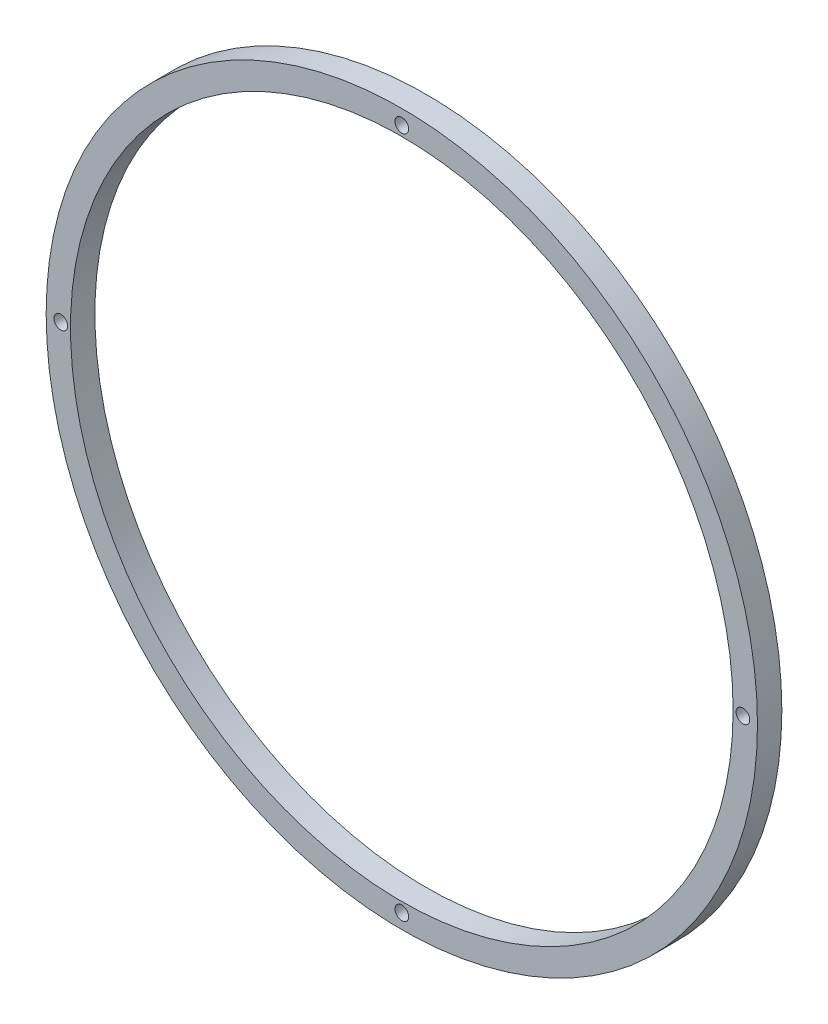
ISO-10303-21;
HEADER;
FILE_DESCRIPTION(('STEP AP214'),'2;1');
FILE_NAME('part.step','',(''),(''),'','','');
FILE_SCHEMA(('AUTOMOTIVE_DESIGN { 1 0 10303 214 1 1 1 1 }'));
ENDSEC;
DATA;
#1=APPLICATION_CONTEXT('core data for automotive mechanical design processes');
#2=APPLICATION_PROTOCOL_DEFINITION('international standard','automotive_design',2000,#1);
#3=PRODUCT_CONTEXT('',#1,'mechanical');
#4=PRODUCT('Part','Part','',(#3));
#5=PRODUCT_RELATED_PRODUCT_CATEGORY('part','',(#4));
#6=PRODUCT_DEFINITION_FORMATION('','',#4);
#7=PRODUCT_DEFINITION_CONTEXT('part definition',#1,'design');
#8=PRODUCT_DEFINITION('design','',#6,#7);
#9=PRODUCT_DEFINITION_SHAPE('','',#8);
#10=(LENGTH_UNIT() NAMED_UNIT(*) SI_UNIT(.MILLI.,.METRE.));
#11=(NAMED_UNIT(*) PLANE_ANGLE_UNIT() SI_UNIT($,.RADIAN.));
#12=(NAMED_UNIT(*) SI_UNIT($,.STERADIAN.) SOLID_ANGLE_UNIT());
#13=UNCERTAINTY_MEASURE_WITH_UNIT(LENGTH_MEASURE(1.E-05),#10,'distance_accuracy_value','');
#14=(GEOMETRIC_REPRESENTATION_CONTEXT(3) GLOBAL_UNCERTAINTY_ASSIGNED_CONTEXT((#13)) GLOBAL_UNIT_ASSIGNED_CONTEXT((#10,
#11,#12)) REPRESENTATION_CONTEXT('',''));
#15=CARTESIAN_POINT('',(0.,0.,0.));
#16=DIRECTION('',(0.,0.,1.));
#17=DIRECTION('',(1.,0.,0.));
#18=AXIS2_PLACEMENT_3D('',#15,#16,#17);
#19=CARTESIAN_POINT('',(0.,0.,6.35));
#20=DIRECTION('',(0.,0.,-1.));
#21=DIRECTION('',(-1.,0.,0.));
#22=AXIS2_PLACEMENT_3D('',#19,#20,#21);
#23=CYLINDRICAL_SURFACE('',#22,86.36);
#24=CARTESIAN_POINT('',(0.,0.,6.35));
#25=DIRECTION('',(0.,0.,1.));
#26=DIRECTION('',(1.,0.,0.));
#27=AXIS2_PLACEMENT_3D('',#24,#25,#26);
#28=CIRCLE('',#27,86.36);
#29=CARTESIAN_POINT('',(86.36,0.,6.35));
#30=VERTEX_POINT('',#29);
#31=EDGE_CURVE('E40',#30,#30,#28,.T.);
#32=ORIENTED_EDGE('',*,*,#31,.T.);
#33=EDGE_LOOP('',(#32));
#34=FACE_BOUND('',#33,.T.);
#35=CARTESIAN_POINT('',(0.,0.,0.));
#36=DIRECTION('',(0.,0.,1.));
#37=DIRECTION('',(1.,0.,0.));
#38=AXIS2_PLACEMENT_3D('',#35,#36,#37);
#39=CIRCLE('',#38,86.36);
#40=CARTESIAN_POINT('',(86.36,0.,0.));
#41=VERTEX_POINT('',#40);
#42=EDGE_CURVE('E60',#41,#41,#39,.T.);
#43=ORIENTED_EDGE('',*,*,#42,.F.);
#44=EDGE_LOOP('',(#43));
#45=FACE_BOUND('',#44,.T.);
#46=ADVANCED_FACE('F32',(#34,#45),#23,.F.);
#47=CARTESIAN_POINT('',(0.,88.9,6.35));
#48=DIRECTION('',(0.,0.,-1.));
#49=DIRECTION('',(-1.,0.,0.));
#50=AXIS2_PLACEMENT_3D('',#47,#48,#49);
#51=CYLINDRICAL_SURFACE('',#50,1.7859375);
#52=CARTESIAN_POINT('',(0.,88.9,6.35));
#53=DIRECTION('',(0.,0.,1.));
#54=DIRECTION('',(1.,0.,0.));
#55=AXIS2_PLACEMENT_3D('',#52,#53,#54);
#56=CIRCLE('',#55,1.7859375);
#57=CARTESIAN_POINT('',(1.7859375,88.9,6.35));
#58=VERTEX_POINT('',#57);
#59=EDGE_CURVE('E45',#58,#58,#56,.T.);
#60=ORIENTED_EDGE('',*,*,#59,.T.);
#61=EDGE_LOOP('',(#60));
#62=FACE_BOUND('',#61,.T.);
#63=CARTESIAN_POINT('',(0.,88.9,0.));
#64=DIRECTION('',(0.,0.,1.));
#65=DIRECTION('',(1.,0.,0.));
#66=AXIS2_PLACEMENT_3D('',#63,#64,#65);
#67=CIRCLE('',#66,1.7859375);
#68=CARTESIAN_POINT('',(1.7859375,88.9,0.));
#69=VERTEX_POINT('',#68);
#70=EDGE_CURVE('E58',#69,#69,#67,.T.);
#71=ORIENTED_EDGE('',*,*,#70,.F.);
#72=EDGE_LOOP('',(#71));
#73=FACE_BOUND('',#72,.T.);
#74=ADVANCED_FACE('F81',(#62,#73),#51,.F.);
#75=CARTESIAN_POINT('',(88.9,2.4980018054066E-12,6.35));
#76=DIRECTION('',(0.,0.,-1.));
#77=DIRECTION('',(-1.,0.,0.));
#78=AXIS2_PLACEMENT_3D('',#75,#76,#77);
#79=CYLINDRICAL_SURFACE('',#78,1.78593750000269);
#80=CARTESIAN_POINT('',(88.9,2.4980018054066E-12,6.35));
#81=DIRECTION('',(0.,0.,1.));
#82=DIRECTION('',(1.,0.,0.));
#83=AXIS2_PLACEMENT_3D('',#80,#81,#82);
#84=CIRCLE('',#83,1.78593750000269);
#85=CARTESIAN_POINT('',(90.6859375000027,2.4980018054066E-12,6.35));
#86=VERTEX_POINT('',#85);
#87=EDGE_CURVE('E74',#86,#86,#84,.T.);
#88=ORIENTED_EDGE('',*,*,#87,.T.);
#89=EDGE_LOOP('',(#88));
#90=FACE_BOUND('',#89,.T.);
#91=CARTESIAN_POINT('',(88.9,2.4980018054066E-12,0.));
#92=DIRECTION('',(0.,0.,1.));
#93=DIRECTION('',(1.,0.,0.));
#94=AXIS2_PLACEMENT_3D('',#91,#92,#93);
#95=CIRCLE('',#94,1.78593750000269);
#96=CARTESIAN_POINT('',(90.6859375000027,2.4980018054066E-12,0.));
#97=VERTEX_POINT('',#96);
#98=EDGE_CURVE('E55',#97,#97,#95,.T.);
#99=ORIENTED_EDGE('',*,*,#98,.F.);
#100=EDGE_LOOP('',(#99));
#101=FACE_BOUND('',#100,.T.);
#102=ADVANCED_FACE('F99',(#90,#101),#79,.F.);
#103=CARTESIAN_POINT('',(2.54744696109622E-12,-88.8999999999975,6.35));
#104=DIRECTION('',(0.,0.,-1.));
#105=DIRECTION('',(-1.,0.,0.));
#106=AXIS2_PLACEMENT_3D('',#103,#104,#105);
#107=CYLINDRICAL_SURFACE('',#106,1.78593750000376);
#108=CARTESIAN_POINT('',(2.54744696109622E-12,-88.8999999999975,6.35));
#109=DIRECTION('',(0.,0.,1.));
#110=DIRECTION('',(1.,0.,0.));
#111=AXIS2_PLACEMENT_3D('',#108,#109,#110);
#112=CIRCLE('',#111,1.78593750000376);
#113=CARTESIAN_POINT('',(1.78593750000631,-88.8999999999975,6.35));
#114=VERTEX_POINT('',#113);
#115=EDGE_CURVE('E69',#114,#114,#112,.T.);
#116=ORIENTED_EDGE('',*,*,#115,.T.);
#117=EDGE_LOOP('',(#116));
#118=FACE_BOUND('',#117,.T.);
#119=CARTESIAN_POINT('',(2.54744696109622E-12,-88.8999999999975,0.));
#120=DIRECTION('',(0.,0.,1.));
#121=DIRECTION('',(1.,0.,0.));
#122=AXIS2_PLACEMENT_3D('',#119,#120,#121);
#123=CIRCLE('',#122,1.78593750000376);
#124=CARTESIAN_POINT('',(1.78593750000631,-88.8999999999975,0.));
#125=VERTEX_POINT('',#124);
#126=EDGE_CURVE('E52',#125,#125,#123,.T.);
#127=ORIENTED_EDGE('',*,*,#126,.F.);
#128=EDGE_LOOP('',(#127));
#129=FACE_BOUND('',#128,.T.);
#130=ADVANCED_FACE('F105',(#118,#129),#107,.F.);
#131=CARTESIAN_POINT('',(-88.8999999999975,0.,6.35));
#132=DIRECTION('',(0.,0.,-1.));
#133=DIRECTION('',(-1.,0.,0.));
#134=AXIS2_PLACEMENT_3D('',#131,#132,#133);
#135=CYLINDRICAL_SURFACE('',#134,1.78593750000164);
#136=CARTESIAN_POINT('',(-88.8999999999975,0.,6.35));
#137=DIRECTION('',(0.,0.,1.));
#138=DIRECTION('',(1.,0.,0.));
#139=AXIS2_PLACEMENT_3D('',#136,#137,#138);
#140=CIRCLE('',#139,1.78593750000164);
#141=CARTESIAN_POINT('',(-87.1140624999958,0.,6.35));
#142=VERTEX_POINT('',#141);
#143=EDGE_CURVE('E65',#142,#142,#140,.T.);
#144=ORIENTED_EDGE('',*,*,#143,.T.);
#145=EDGE_LOOP('',(#144));
#146=FACE_BOUND('',#145,.T.);
#147=CARTESIAN_POINT('',(-88.8999999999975,0.,0.));
#148=DIRECTION('',(0.,0.,1.));
#149=DIRECTION('',(1.,0.,0.));
#150=AXIS2_PLACEMENT_3D('',#147,#148,#149);
#151=CIRCLE('',#150,1.78593750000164);
#152=CARTESIAN_POINT('',(-87.1140624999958,0.,0.));
#153=VERTEX_POINT('',#152);
#154=EDGE_CURVE('E49',#153,#153,#151,.T.);
#155=ORIENTED_EDGE('',*,*,#154,.F.);
#156=EDGE_LOOP('',(#155));
#157=FACE_BOUND('',#156,.T.);
#158=ADVANCED_FACE('F34',(#146,#157),#135,.F.);
#159=CARTESIAN_POINT('',(0.,0.,6.35));
#160=DIRECTION('',(0.,0.,-1.));
#161=DIRECTION('',(-1.,0.,0.));
#162=AXIS2_PLACEMENT_3D('',#159,#160,#161);
#163=CYLINDRICAL_SURFACE('',#162,92.71);
#164=CARTESIAN_POINT('',(0.,0.,6.35));
#165=DIRECTION('',(0.,0.,1.));
#166=DIRECTION('',(1.,0.,0.));
#167=AXIS2_PLACEMENT_3D('',#164,#165,#166);
#168=CIRCLE('',#167,92.71);
#169=CARTESIAN_POINT('',(92.71,0.,6.35));
#170=VERTEX_POINT('',#169);
#171=EDGE_CURVE('E10',#170,#170,#168,.T.);
#172=ORIENTED_EDGE('',*,*,#171,.F.);
#173=EDGE_LOOP('',(#172));
#174=FACE_BOUND('',#173,.T.);
#175=CARTESIAN_POINT('',(0.,0.,0.));
#176=DIRECTION('',(0.,0.,1.));
#177=DIRECTION('',(1.,0.,0.));
#178=AXIS2_PLACEMENT_3D('',#175,#176,#177);
#179=CIRCLE('',#178,92.71);
#180=CARTESIAN_POINT('',(92.71,0.,0.));
#181=VERTEX_POINT('',#180);
#182=EDGE_CURVE('E36',#181,#181,#179,.T.);
#183=ORIENTED_EDGE('',*,*,#182,.T.);
#184=EDGE_LOOP('',(#183));
#185=FACE_BOUND('',#184,.T.);
#186=ADVANCED_FACE('F88',(#174,#185),#163,.T.);
#187=CARTESIAN_POINT('',(0.,0.,6.35));
#188=DIRECTION('',(0.,0.,1.));
#189=DIRECTION('',(1.,0.,0.));
#190=AXIS2_PLACEMENT_3D('',#187,#188,#189);
#191=PLANE('',#190);
#192=ORIENTED_EDGE('',*,*,#143,.F.);
#193=EDGE_LOOP('',(#192));
#194=FACE_BOUND('',#193,.T.);
#195=ORIENTED_EDGE('',*,*,#115,.F.);
#196=EDGE_LOOP('',(#195));
#197=FACE_BOUND('',#196,.T.);
#198=ORIENTED_EDGE('',*,*,#87,.F.);
#199=EDGE_LOOP('',(#198));
#200=FACE_BOUND('',#199,.T.);
#201=ORIENTED_EDGE('',*,*,#59,.F.);
#202=EDGE_LOOP('',(#201));
#203=FACE_BOUND('',#202,.T.);
#204=ORIENTED_EDGE('',*,*,#31,.F.);
#205=EDGE_LOOP('',(#204));
#206=FACE_BOUND('',#205,.T.);
#207=ORIENTED_EDGE('',*,*,#171,.T.);
#208=EDGE_LOOP('',(#207));
#209=FACE_BOUND('',#208,.T.);
#210=ADVANCED_FACE('F84',(#194,#197,#200,#203,#206,#209),#191,.T.);
#211=CARTESIAN_POINT('',(0.,0.,0.));
#212=DIRECTION('',(0.,0.,1.));
#213=DIRECTION('',(1.,0.,0.));
#214=AXIS2_PLACEMENT_3D('',#211,#212,#213);
#215=PLANE('',#214);
#216=ORIENTED_EDGE('',*,*,#154,.T.);
#217=EDGE_LOOP('',(#216));
#218=FACE_BOUND('',#217,.T.);
#219=ORIENTED_EDGE('',*,*,#126,.T.);
#220=EDGE_LOOP('',(#219));
#221=FACE_BOUND('',#220,.T.);
#222=ORIENTED_EDGE('',*,*,#98,.T.);
#223=EDGE_LOOP('',(#222));
#224=FACE_BOUND('',#223,.T.);
#225=ORIENTED_EDGE('',*,*,#70,.T.);
#226=EDGE_LOOP('',(#225));
#227=FACE_BOUND('',#226,.T.);
#228=ORIENTED_EDGE('',*,*,#42,.T.);
#229=EDGE_LOOP('',(#228));
#230=FACE_BOUND('',#229,.T.);
#231=ORIENTED_EDGE('',*,*,#182,.F.);
#232=EDGE_LOOP('',(#231));
#233=FACE_BOUND('',#232,.T.);
#234=ADVANCED_FACE('F87',(#218,#221,#224,#227,#230,#233),#215,.F.);
#235=CLOSED_SHELL('',(#46,#74,#102,#130,#158,#186,#210,#234));
#236=MANIFOLD_SOLID_BREP('B2',#235);
#237=ADVANCED_BREP_SHAPE_REPRESENTATION('',(#18,#236),#14);
#238=SHAPE_DEFINITION_REPRESENTATION(#9,#237);
ENDSEC;
END-ISO-10303-21;
